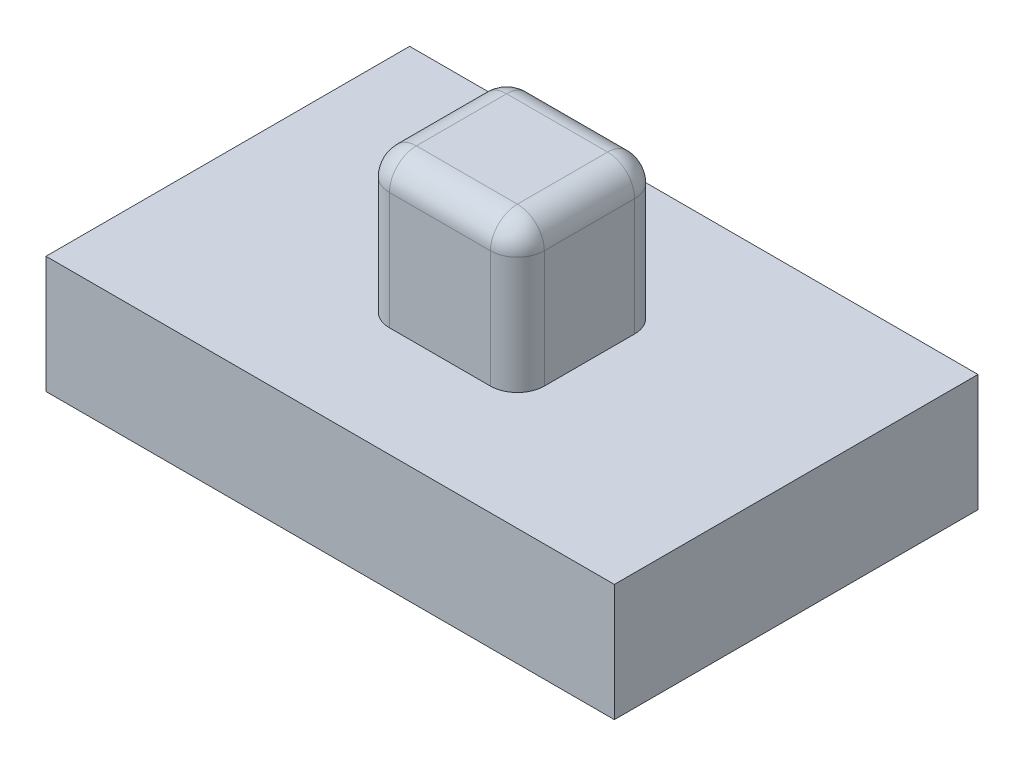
from build123d import *

# Parameters (mm, degrees)
SKETCH1_W           = 4.22
SKETCH1_H           = 2.7
BOSS_EXTRUDE1_DEPTH = 0.87
SKETCH2_W           = 1.15
SKETCH2_H           = 1.07
BOSS_EXTRUDE2_DEPTH = 1.07
FILLET1_R           = 0.2


with BuildPart() as part:
    # Sketch1 → Boss-Extrude1 (new body)
    with BuildSketch(Plane(origin=(0, 0, 0), x_dir=(1, 0, 0), z_dir=(0, 1, 0))):
        Rectangle(SKETCH1_W, SKETCH1_H)
    extrude(amount=BOSS_EXTRUDE1_DEPTH)

    # Sketch2 → Boss-Extrude2 (add)
    with BuildSketch(Plane(origin=(0, 0.87, 0), x_dir=(1, 0, 0), z_dir=(0, 1, 0))):
        Rectangle(SKETCH2_W, SKETCH2_H)
    extrude(amount=BOSS_EXTRUDE2_DEPTH)

    # Fillet1
    fillet1_edges = [part.edges().sort_by_distance(p)[0] for p in [
        (0.575, 1.405, 0.535),
        (0.575, 1.405, -0.535),
        (-0.575, 1.405, -0.535),
        (-0.575, 1.405, 0.535),
        (0.575, 1.94, 0),
        (0, 1.94, -0.535),
        (-0.575, 1.94, 0),
        (0, 1.94, 0.535),
    ]]
    fillet(fillet1_edges, radius=FILLET1_R)


solid = part.part
